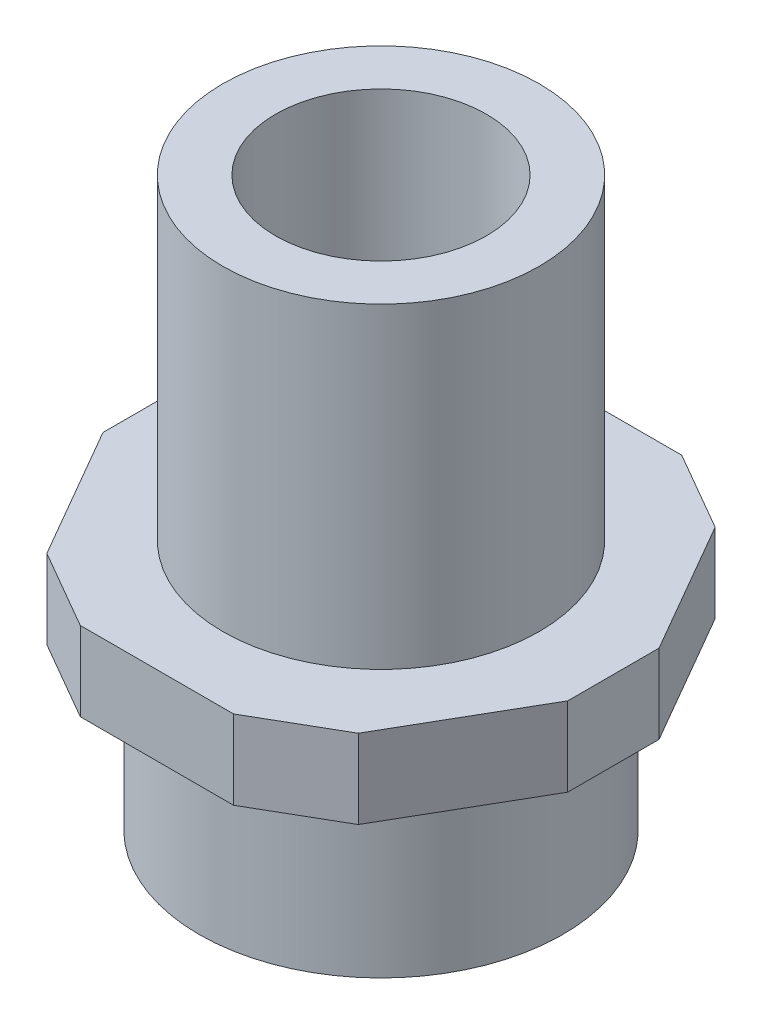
from build123d import *

# Parameters (mm, degrees)
EXTRUSION1_DEPTH = 3
ESQUISSE2_R      = 6
ESQUISSE2_R_2    = 4
EXTRUSION2_DEPTH = 12
ESQUISSE3_R      = 6.9
EXTRUSION3_DEPTH = 6.5
CHANFREIN1_SIZE  = 2


with BuildPart() as part:
    # Esquisse1 → Extrusion1 (new body)
    with BuildSketch(Plane(origin=(0, 0, 0), x_dir=(1, 0, 0), z_dir=(0, 1, 0))):
        Polygon((9.814954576, 0), (4.907477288, 8.5), (-4.907477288, 8.5), (-9.814954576, 0), (-4.907477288, -8.5), (4.907477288, -8.5), align=None)
    extrude(amount=EXTRUSION1_DEPTH)

    # Esquisse2 → Extrusion2 (add)
    with BuildSketch(Plane(origin=(0, 3, 0), x_dir=(1, 0, 0), z_dir=(0, 1, 0))):
        with Locations(Location((0, 0, 0), (0, 0, 270))):
            Circle(ESQUISSE2_R)
        with Locations(Location((0, 0, 0), (0, 0, 270))):
            Circle(ESQUISSE2_R_2, mode=Mode.SUBTRACT)
    extrude(amount=EXTRUSION2_DEPTH)

    # Esquisse3 → Extrusion3 (add)
    with BuildSketch(Plane.XZ):
        with Locations(Location((0, 0, 0), (0, 0, 90))):
            Circle(ESQUISSE3_R)
    extrude(amount=EXTRUSION3_DEPTH)

    # Chanfrein1
    chanfrein1_edges = [part.edges().sort_by_distance(p)[0] for p in [
        (4.907477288, 1.5, 8.5),
        (-4.907477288, 1.5, 8.5),
        (-9.814954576, 1.5, 0),
        (-4.907477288, 1.5, -8.5),
        (4.907477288, 1.5, -8.5),
        (9.814954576, 1.5, 0),
    ]]
    chamfer(chanfrein1_edges, length=CHANFREIN1_SIZE)


solid = part.part
